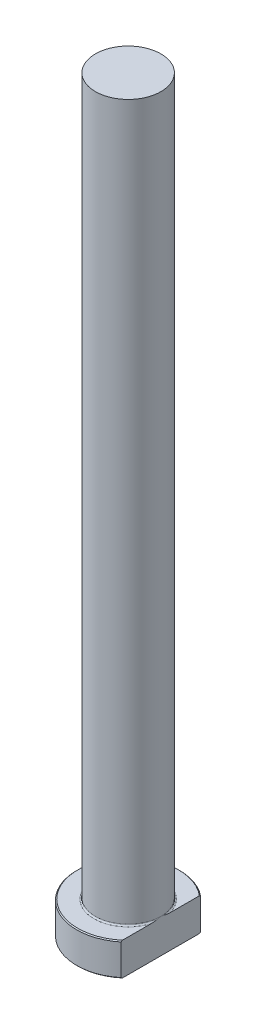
from build123d import *
from build123d.topology import SkipClean

# Parameters (mm, degrees)
CHAMFER1_SIZE = 0.2
FILLET1_R     = 0.3
KEY_DEPTH     = 161.754471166


with BuildPart() as part:
    # Sketch1 → Revolve1 (revolve)
    with BuildSketch(Plane.XY, mode=Mode.PRIVATE) as revolve1_sk:
        Polygon((0, 0), (-11, 0), (-11, 7), (-7, 7), (-7, 160), (0, 160), align=None)
    revolve(revolve1_sk.sketch.rotate(Axis((0, 259.958771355, 0), (0, -1, 0)), 270), axis=Axis((0, 259.958771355, 0), (0, -1, 0)))

    # Chamfer1
    chamfer1_edges = [part.edges().sort_by_distance(p)[0] for p in [
        (0, 7, -11),
        (0, 0, -11),
    ]]
    chamfer(chamfer1_edges, length=CHAMFER1_SIZE)

    # Fillet1
    fillet1_edges = [part.edges().sort_by_distance(p)[0] for p in [
        (0, 7, -7),
    ]]
    fillet(fillet1_edges, radius=FILLET1_R)

    # Sketch2 → KEY (cut, through all)
    with SkipClean():  # the faces are left unmerged after this step: merging them gives an invalid solid
        with BuildSketch(Plane(origin=(0, 0, 0), x_dir=(1, 0, 0), z_dir=(0, 1, 0))):
            with BuildLine():
                Line((7, 8.485281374), (7, -8.485281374))
                ThreePointArc((7, -8.485281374), (11, 0), (7, 8.485281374))
            make_face()
        extrude(amount=KEY_DEPTH, mode=Mode.SUBTRACT)


solid = part.part
